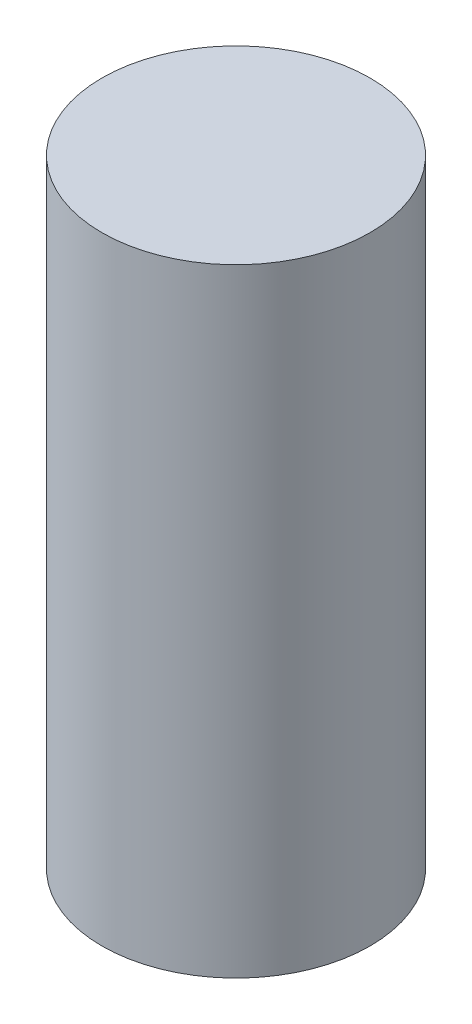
ISO-10303-21;
HEADER;
FILE_DESCRIPTION(('STEP AP214'),'2;1');
FILE_NAME('part.step','',(''),(''),'','','');
FILE_SCHEMA(('AUTOMOTIVE_DESIGN { 1 0 10303 214 1 1 1 1 }'));
ENDSEC;
DATA;
#1=APPLICATION_CONTEXT('core data for automotive mechanical design processes');
#2=APPLICATION_PROTOCOL_DEFINITION('international standard','automotive_design',2000,#1);
#3=PRODUCT_CONTEXT('',#1,'mechanical');
#4=PRODUCT('Part','Part','',(#3));
#5=PRODUCT_RELATED_PRODUCT_CATEGORY('part','',(#4));
#6=PRODUCT_DEFINITION_FORMATION('','',#4);
#7=PRODUCT_DEFINITION_CONTEXT('part definition',#1,'design');
#8=PRODUCT_DEFINITION('design','',#6,#7);
#9=PRODUCT_DEFINITION_SHAPE('','',#8);
#10=(LENGTH_UNIT() NAMED_UNIT(*) SI_UNIT(.MILLI.,.METRE.));
#11=(NAMED_UNIT(*) PLANE_ANGLE_UNIT() SI_UNIT($,.RADIAN.));
#12=(NAMED_UNIT(*) SI_UNIT($,.STERADIAN.) SOLID_ANGLE_UNIT());
#13=UNCERTAINTY_MEASURE_WITH_UNIT(LENGTH_MEASURE(1.E-05),#10,'distance_accuracy_value','');
#14=(GEOMETRIC_REPRESENTATION_CONTEXT(3) GLOBAL_UNCERTAINTY_ASSIGNED_CONTEXT((#13)) GLOBAL_UNIT_ASSIGNED_CONTEXT((#10,
#11,#12)) REPRESENTATION_CONTEXT('',''));
#15=CARTESIAN_POINT('',(0.,0.,0.));
#16=DIRECTION('',(0.,0.,1.));
#17=DIRECTION('',(1.,0.,0.));
#18=AXIS2_PLACEMENT_3D('',#15,#16,#17);
#19=CARTESIAN_POINT('',(0.,41.5036,0.));
#20=DIRECTION('',(0.,-1.,0.));
#21=DIRECTION('',(0.,0.,-1.));
#22=AXIS2_PLACEMENT_3D('',#19,#20,#21);
#23=CYLINDRICAL_SURFACE('',#22,9.0043);
#24=CARTESIAN_POINT('',(0.,41.5036,0.));
#25=DIRECTION('',(0.,1.,0.));
#26=DIRECTION('',(0.,0.,1.));
#27=AXIS2_PLACEMENT_3D('',#24,#25,#26);
#28=CIRCLE('',#27,9.0043);
#29=CARTESIAN_POINT('',(0.,41.5036,-9.0043));
#30=VERTEX_POINT('',#29);
#31=EDGE_CURVE('E10',#30,#30,#28,.T.);
#32=CARTESIAN_POINT('',(0.,0.,0.));
#33=DIRECTION('',(0.,1.,0.));
#34=DIRECTION('',(0.,0.,1.));
#35=AXIS2_PLACEMENT_3D('',#32,#33,#34);
#36=CIRCLE('',#35,9.0043);
#37=CARTESIAN_POINT('',(0.,0.,-9.0043));
#38=VERTEX_POINT('',#37);
#39=EDGE_CURVE('E34',#38,#38,#36,.T.);
#40=CARTESIAN_POINT('',(0.,41.5036,-9.0043));
#41=CARTESIAN_POINT('',(0.,41.0712708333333,-9.0043));
#42=CARTESIAN_POINT('',(0.,40.6389416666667,-9.0043));
#43=CARTESIAN_POINT('',(0.,39.7742833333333,-9.0043));
#44=CARTESIAN_POINT('',(0.,39.3419541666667,-9.0043));
#45=CARTESIAN_POINT('',(0.,38.4772958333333,-9.0043));
#46=CARTESIAN_POINT('',(0.,38.0449666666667,-9.0043));
#47=CARTESIAN_POINT('',(0.,37.1803083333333,-9.0043));
#48=CARTESIAN_POINT('',(0.,36.7479791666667,-9.0043));
#49=CARTESIAN_POINT('',(0.,35.8833208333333,-9.0043));
#50=CARTESIAN_POINT('',(0.,35.4509916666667,-9.0043));
#51=CARTESIAN_POINT('',(0.,34.5863333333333,-9.0043));
#52=CARTESIAN_POINT('',(0.,34.1540041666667,-9.0043));
#53=CARTESIAN_POINT('',(0.,33.2893458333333,-9.0043));
#54=CARTESIAN_POINT('',(0.,32.8570166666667,-9.0043));
#55=CARTESIAN_POINT('',(0.,31.9923583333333,-9.0043));
#56=CARTESIAN_POINT('',(0.,31.5600291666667,-9.0043));
#57=CARTESIAN_POINT('',(0.,30.6953708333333,-9.0043));
#58=CARTESIAN_POINT('',(0.,30.2630416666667,-9.0043));
#59=CARTESIAN_POINT('',(0.,29.3983833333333,-9.0043));
#60=CARTESIAN_POINT('',(0.,28.9660541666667,-9.0043));
#61=CARTESIAN_POINT('',(0.,28.1013958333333,-9.0043));
#62=CARTESIAN_POINT('',(0.,27.6690666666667,-9.0043));
#63=CARTESIAN_POINT('',(0.,26.8044083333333,-9.0043));
#64=CARTESIAN_POINT('',(0.,26.3720791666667,-9.0043));
#65=CARTESIAN_POINT('',(0.,25.5074208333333,-9.0043));
#66=CARTESIAN_POINT('',(0.,25.0750916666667,-9.0043));
#67=CARTESIAN_POINT('',(0.,24.2104333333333,-9.0043));
#68=CARTESIAN_POINT('',(0.,23.7781041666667,-9.0043));
#69=CARTESIAN_POINT('',(0.,22.9134458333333,-9.0043));
#70=CARTESIAN_POINT('',(0.,22.4811166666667,-9.0043));
#71=CARTESIAN_POINT('',(0.,21.6164583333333,-9.0043));
#72=CARTESIAN_POINT('',(0.,21.1841291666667,-9.0043));
#73=CARTESIAN_POINT('',(0.,20.3194708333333,-9.0043));
#74=CARTESIAN_POINT('',(0.,19.8871416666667,-9.0043));
#75=CARTESIAN_POINT('',(0.,19.0224833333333,-9.0043));
#76=CARTESIAN_POINT('',(0.,18.5901541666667,-9.0043));
#77=CARTESIAN_POINT('',(0.,17.7254958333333,-9.0043));
#78=CARTESIAN_POINT('',(0.,17.2931666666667,-9.0043));
#79=CARTESIAN_POINT('',(0.,16.4285083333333,-9.0043));
#80=CARTESIAN_POINT('',(0.,15.9961791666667,-9.0043));
#81=CARTESIAN_POINT('',(0.,15.1315208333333,-9.0043));
#82=CARTESIAN_POINT('',(0.,14.6991916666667,-9.0043));
#83=CARTESIAN_POINT('',(0.,13.8345333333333,-9.0043));
#84=CARTESIAN_POINT('',(0.,13.4022041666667,-9.0043));
#85=CARTESIAN_POINT('',(0.,12.5375458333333,-9.0043));
#86=CARTESIAN_POINT('',(0.,12.1052166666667,-9.0043));
#87=CARTESIAN_POINT('',(0.,11.2405583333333,-9.0043));
#88=CARTESIAN_POINT('',(0.,10.8082291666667,-9.0043));
#89=CARTESIAN_POINT('',(0.,9.94357083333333,-9.0043));
#90=CARTESIAN_POINT('',(0.,9.51124166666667,-9.0043));
#91=CARTESIAN_POINT('',(0.,8.64658333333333,-9.0043));
#92=CARTESIAN_POINT('',(0.,8.21425416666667,-9.0043));
#93=CARTESIAN_POINT('',(0.,7.34959583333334,-9.0043));
#94=CARTESIAN_POINT('',(0.,6.91726666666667,-9.0043));
#95=CARTESIAN_POINT('',(0.,6.05260833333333,-9.0043));
#96=CARTESIAN_POINT('',(0.,5.62027916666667,-9.0043));
#97=CARTESIAN_POINT('',(0.,4.75562083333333,-9.0043));
#98=CARTESIAN_POINT('',(0.,4.32329166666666,-9.0043));
#99=CARTESIAN_POINT('',(0.,3.45863333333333,-9.0043));
#100=CARTESIAN_POINT('',(0.,3.02630416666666,-9.0043));
#101=CARTESIAN_POINT('',(0.,2.16164583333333,-9.0043));
#102=CARTESIAN_POINT('',(0.,1.72931666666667,-9.0043));
#103=CARTESIAN_POINT('',(0.,0.864658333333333,-9.0043));
#104=CARTESIAN_POINT('',(0.,0.432329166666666,-9.0043));
#105=CARTESIAN_POINT('',(0.,0.,-9.0043));
#106=B_SPLINE_CURVE_WITH_KNOTS('',3,(#40,#41,#42,#43,#44,#45,#46,#47,#48,#49,#50,#51,#52,#53,
#54,#55,#56,#57,#58,#59,#60,#61,#62,#63,#64,#65,#66,#67,#68,#69,#70,#71,#72,#73,#74,#75,#76,#77,
#78,#79,#80,#81,#82,#83,#84,#85,#86,#87,#88,#89,#90,#91,#92,#93,#94,#95,#96,#97,#98,#99,#100,
#101,#102,#103,#104,#105),.UNSPECIFIED.,.F.,.F.,(4,2,2,2,2,2,2,2,2,2,2,2,2,2,2,2,2,2,2,2,2,2,2,
2,2,2,2,2,2,2,2,2,4),(0.,1.29698750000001,2.59397500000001,3.8909625,5.18795,6.4849375,7.781925,
9.0789125,10.3759,11.6728875,12.969875,14.2668625,15.56385,16.8608375,18.157825,19.4548125,
20.7518,22.0487875,23.345775,24.6427625,25.93975,27.2367375,28.533725,29.8307125,31.1277,
32.4246875,33.721675,35.0186625,36.31565,37.6126375,38.909625,40.2066125,41.5036),.UNSPECIFIED.);
#107=EDGE_CURVE('BSEAM31',#30,#38,#106,.T.);
#108=ORIENTED_EDGE('',*,*,#31,.F.);
#109=ORIENTED_EDGE('',*,*,#39,.T.);
#110=ORIENTED_EDGE('',*,*,#107,.T.);
#111=ORIENTED_EDGE('',*,*,#107,.F.);
#112=EDGE_LOOP('',(#108,#110,#109,#111));
#113=FACE_BOUND('',#112,.T.);
#114=ADVANCED_FACE('F31',(#113),#23,.T.);
#115=CARTESIAN_POINT('',(0.,41.5036,0.));
#116=DIRECTION('',(0.,1.,0.));
#117=DIRECTION('',(0.,0.,1.));
#118=AXIS2_PLACEMENT_3D('',#115,#116,#117);
#119=PLANE('',#118);
#120=ORIENTED_EDGE('',*,*,#31,.T.);
#121=EDGE_LOOP('',(#120));
#122=FACE_BOUND('',#121,.T.);
#123=ADVANCED_FACE('F46',(#122),#119,.T.);
#124=CARTESIAN_POINT('',(0.,0.,0.));
#125=DIRECTION('',(0.,1.,0.));
#126=DIRECTION('',(0.,0.,1.));
#127=AXIS2_PLACEMENT_3D('',#124,#125,#126);
#128=PLANE('',#127);
#129=ORIENTED_EDGE('',*,*,#39,.F.);
#130=EDGE_LOOP('',(#129));
#131=FACE_BOUND('',#130,.T.);
#132=ADVANCED_FACE('F44',(#131),#128,.F.);
#133=CLOSED_SHELL('',(#114,#123,#132));
#134=MANIFOLD_SOLID_BREP('B2',#133);
#135=ADVANCED_BREP_SHAPE_REPRESENTATION('',(#18,#134),#14);
#136=SHAPE_DEFINITION_REPRESENTATION(#9,#135);
ENDSEC;
END-ISO-10303-21;
